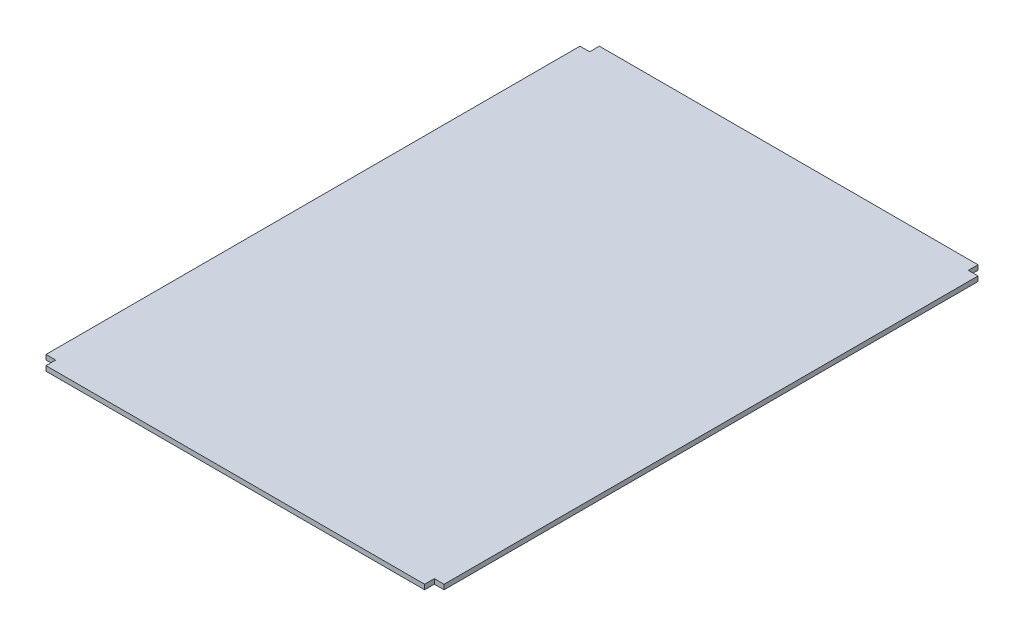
ISO-10303-21;
HEADER;
FILE_DESCRIPTION(('STEP AP214'),'2;1');
FILE_NAME('part.step','',(''),(''),'','','');
FILE_SCHEMA(('AUTOMOTIVE_DESIGN { 1 0 10303 214 1 1 1 1 }'));
ENDSEC;
DATA;
#1=APPLICATION_CONTEXT('core data for automotive mechanical design processes');
#2=APPLICATION_PROTOCOL_DEFINITION('international standard','automotive_design',2000,#1);
#3=PRODUCT_CONTEXT('',#1,'mechanical');
#4=PRODUCT('Part','Part','',(#3));
#5=PRODUCT_RELATED_PRODUCT_CATEGORY('part','',(#4));
#6=PRODUCT_DEFINITION_FORMATION('','',#4);
#7=PRODUCT_DEFINITION_CONTEXT('part definition',#1,'design');
#8=PRODUCT_DEFINITION('design','',#6,#7);
#9=PRODUCT_DEFINITION_SHAPE('','',#8);
#10=(LENGTH_UNIT() NAMED_UNIT(*) SI_UNIT(.MILLI.,.METRE.));
#11=(NAMED_UNIT(*) PLANE_ANGLE_UNIT() SI_UNIT($,.RADIAN.));
#12=(NAMED_UNIT(*) SI_UNIT($,.STERADIAN.) SOLID_ANGLE_UNIT());
#13=UNCERTAINTY_MEASURE_WITH_UNIT(LENGTH_MEASURE(1.E-05),#10,'distance_accuracy_value','');
#14=(GEOMETRIC_REPRESENTATION_CONTEXT(3) GLOBAL_UNCERTAINTY_ASSIGNED_CONTEXT((#13)) GLOBAL_UNIT_ASSIGNED_CONTEXT((#10,
#11,#12)) REPRESENTATION_CONTEXT('',''));
#15=CARTESIAN_POINT('',(0.,0.,0.));
#16=DIRECTION('',(0.,0.,1.));
#17=DIRECTION('',(1.,0.,0.));
#18=AXIS2_PLACEMENT_3D('',#15,#16,#17);
#19=CARTESIAN_POINT('',(260.35,6.35,361.95));
#20=DIRECTION('',(-1.,0.,0.));
#21=DIRECTION('',(0.,0.,1.));
#22=AXIS2_PLACEMENT_3D('',#19,#20,#21);
#23=PLANE('',#22);
#24=DIRECTION('',(0.,0.,-1.));
#25=VECTOR('',#24,1.);
#26=CARTESIAN_POINT('',(260.35,0.,361.95));
#27=LINE('',#26,#25);
#28=CARTESIAN_POINT('',(260.35,0.,349.25));
#29=VERTEX_POINT('',#28);
#30=CARTESIAN_POINT('',(260.35,0.,-349.25));
#31=VERTEX_POINT('',#30);
#32=EDGE_CURVE('E145',#29,#31,#27,.T.);
#33=ORIENTED_EDGE('',*,*,#32,.T.);
#34=DIRECTION('',(0.,1.,0.));
#35=VECTOR('',#34,1.);
#36=CARTESIAN_POINT('',(260.35,0.,-349.25));
#37=LINE('',#36,#35);
#38=CARTESIAN_POINT('',(260.35,6.35,-349.25));
#39=VERTEX_POINT('',#38);
#40=EDGE_CURVE('E188',#31,#39,#37,.T.);
#41=ORIENTED_EDGE('',*,*,#40,.T.);
#42=DIRECTION('',(0.,0.,-1.));
#43=VECTOR('',#42,1.);
#44=CARTESIAN_POINT('',(260.35,6.35,361.95));
#45=LINE('',#44,#43);
#46=CARTESIAN_POINT('',(260.35,6.35,349.25));
#47=VERTEX_POINT('',#46);
#48=EDGE_CURVE('E153',#47,#39,#45,.T.);
#49=ORIENTED_EDGE('',*,*,#48,.F.);
#50=DIRECTION('',(0.,1.,0.));
#51=VECTOR('',#50,1.);
#52=CARTESIAN_POINT('',(260.35,0.,349.25));
#53=LINE('',#52,#51);
#54=EDGE_CURVE('E175',#29,#47,#53,.T.);
#55=ORIENTED_EDGE('',*,*,#54,.F.);
#56=EDGE_LOOP('',(#33,#41,#49,#55));
#57=FACE_BOUND('',#56,.T.);
#58=ADVANCED_FACE('F33',(#57),#23,.F.);
#59=CARTESIAN_POINT('',(-260.35,6.35,-361.95));
#60=DIRECTION('',(0.,0.,1.));
#61=DIRECTION('',(1.,0.,0.));
#62=AXIS2_PLACEMENT_3D('',#59,#60,#61);
#63=PLANE('',#62);
#64=DIRECTION('',(-1.,0.,0.));
#65=VECTOR('',#64,1.);
#66=CARTESIAN_POINT('',(-260.35,6.35,-361.95));
#67=LINE('',#66,#65);
#68=CARTESIAN_POINT('',(247.65,6.35,-361.95));
#69=VERTEX_POINT('',#68);
#70=CARTESIAN_POINT('',(-247.65,6.35,-361.95));
#71=VERTEX_POINT('',#70);
#72=EDGE_CURVE('E140',#69,#71,#67,.T.);
#73=ORIENTED_EDGE('',*,*,#72,.F.);
#74=DIRECTION('',(0.,1.,0.));
#75=VECTOR('',#74,1.);
#76=CARTESIAN_POINT('',(247.65,0.,-361.95));
#77=LINE('',#76,#75);
#78=CARTESIAN_POINT('',(247.65,0.,-361.95));
#79=VERTEX_POINT('',#78);
#80=EDGE_CURVE('E126',#79,#69,#77,.T.);
#81=ORIENTED_EDGE('',*,*,#80,.F.);
#82=DIRECTION('',(-1.,0.,0.));
#83=VECTOR('',#82,1.);
#84=CARTESIAN_POINT('',(-260.35,0.,-361.95));
#85=LINE('',#84,#83);
#86=CARTESIAN_POINT('',(-247.65,0.,-361.95));
#87=VERTEX_POINT('',#86);
#88=EDGE_CURVE('E138',#79,#87,#85,.T.);
#89=ORIENTED_EDGE('',*,*,#88,.T.);
#90=DIRECTION('',(0.,1.,0.));
#91=VECTOR('',#90,1.);
#92=CARTESIAN_POINT('',(-247.65,0.,-361.95));
#93=LINE('',#92,#91);
#94=EDGE_CURVE('E197',#87,#71,#93,.T.);
#95=ORIENTED_EDGE('',*,*,#94,.T.);
#96=EDGE_LOOP('',(#73,#81,#89,#95));
#97=FACE_BOUND('',#96,.T.);
#98=ADVANCED_FACE('F136',(#97),#63,.F.);
#99=CARTESIAN_POINT('',(-260.35,6.35,361.95));
#100=DIRECTION('',(1.,0.,0.));
#101=DIRECTION('',(0.,0.,-1.));
#102=AXIS2_PLACEMENT_3D('',#99,#100,#101);
#103=PLANE('',#102);
#104=DIRECTION('',(0.,0.,1.));
#105=VECTOR('',#104,1.);
#106=CARTESIAN_POINT('',(-260.35,6.35,361.95));
#107=LINE('',#106,#105);
#108=CARTESIAN_POINT('',(-260.35,6.35,-349.25));
#109=VERTEX_POINT('',#108);
#110=CARTESIAN_POINT('',(-260.35,6.35,349.25));
#111=VERTEX_POINT('',#110);
#112=EDGE_CURVE('E41',#109,#111,#107,.T.);
#113=ORIENTED_EDGE('',*,*,#112,.F.);
#114=DIRECTION('',(0.,1.,0.));
#115=VECTOR('',#114,1.);
#116=CARTESIAN_POINT('',(-260.35,0.,-349.25));
#117=LINE('',#116,#115);
#118=CARTESIAN_POINT('',(-260.35,0.,-349.25));
#119=VERTEX_POINT('',#118);
#120=EDGE_CURVE('E193',#119,#109,#117,.T.);
#121=ORIENTED_EDGE('',*,*,#120,.F.);
#122=DIRECTION('',(0.,0.,1.));
#123=VECTOR('',#122,1.);
#124=CARTESIAN_POINT('',(-260.35,0.,361.95));
#125=LINE('',#124,#123);
#126=CARTESIAN_POINT('',(-260.35,0.,349.25));
#127=VERTEX_POINT('',#126);
#128=EDGE_CURVE('E144',#119,#127,#125,.T.);
#129=ORIENTED_EDGE('',*,*,#128,.T.);
#130=DIRECTION('',(0.,1.,0.));
#131=VECTOR('',#130,1.);
#132=CARTESIAN_POINT('',(-260.35,0.,349.25));
#133=LINE('',#132,#131);
#134=EDGE_CURVE('E148',#127,#111,#133,.T.);
#135=ORIENTED_EDGE('',*,*,#134,.T.);
#136=EDGE_LOOP('',(#113,#121,#129,#135));
#137=FACE_BOUND('',#136,.T.);
#138=ADVANCED_FACE('F244',(#137),#103,.F.);
#139=CARTESIAN_POINT('',(-260.35,6.35,361.95));
#140=DIRECTION('',(0.,0.,-1.));
#141=DIRECTION('',(-1.,0.,0.));
#142=AXIS2_PLACEMENT_3D('',#139,#140,#141);
#143=PLANE('',#142);
#144=DIRECTION('',(1.,0.,0.));
#145=VECTOR('',#144,1.);
#146=CARTESIAN_POINT('',(-260.35,0.,361.95));
#147=LINE('',#146,#145);
#148=CARTESIAN_POINT('',(-247.65,0.,361.95));
#149=VERTEX_POINT('',#148);
#150=CARTESIAN_POINT('',(247.65,0.,361.95));
#151=VERTEX_POINT('',#150);
#152=EDGE_CURVE('E36',#149,#151,#147,.T.);
#153=ORIENTED_EDGE('',*,*,#152,.T.);
#154=DIRECTION('',(0.,1.,0.));
#155=VECTOR('',#154,1.);
#156=CARTESIAN_POINT('',(247.65,0.,361.95));
#157=LINE('',#156,#155);
#158=CARTESIAN_POINT('',(247.65,6.35,361.95));
#159=VERTEX_POINT('',#158);
#160=EDGE_CURVE('E170',#151,#159,#157,.T.);
#161=ORIENTED_EDGE('',*,*,#160,.T.);
#162=DIRECTION('',(1.,0.,0.));
#163=VECTOR('',#162,1.);
#164=CARTESIAN_POINT('',(-260.35,6.35,361.95));
#165=LINE('',#164,#163);
#166=CARTESIAN_POINT('',(-247.65,6.35,361.95));
#167=VERTEX_POINT('',#166);
#168=EDGE_CURVE('E11',#167,#159,#165,.T.);
#169=ORIENTED_EDGE('',*,*,#168,.F.);
#170=DIRECTION('',(0.,1.,0.));
#171=VECTOR('',#170,1.);
#172=CARTESIAN_POINT('',(-247.65,0.,361.95));
#173=LINE('',#172,#171);
#174=EDGE_CURVE('E156',#149,#167,#173,.T.);
#175=ORIENTED_EDGE('',*,*,#174,.F.);
#176=EDGE_LOOP('',(#153,#161,#169,#175));
#177=FACE_BOUND('',#176,.T.);
#178=ADVANCED_FACE('F231',(#177),#143,.F.);
#179=CARTESIAN_POINT('',(0.,6.35,0.));
#180=DIRECTION('',(0.,-1.,0.));
#181=DIRECTION('',(0.,0.,-1.));
#182=AXIS2_PLACEMENT_3D('',#179,#180,#181);
#183=PLANE('',#182);
#184=ORIENTED_EDGE('',*,*,#48,.T.);
#185=DIRECTION('',(1.,0.,0.));
#186=VECTOR('',#185,1.);
#187=CARTESIAN_POINT('',(260.35,6.35,-349.25));
#188=LINE('',#187,#186);
#189=CARTESIAN_POINT('',(247.65,6.35,-349.25));
#190=VERTEX_POINT('',#189);
#191=EDGE_CURVE('E131',#190,#39,#188,.T.);
#192=ORIENTED_EDGE('',*,*,#191,.F.);
#193=DIRECTION('',(0.,0.,1.));
#194=VECTOR('',#193,1.);
#195=CARTESIAN_POINT('',(247.65,6.35,-361.95));
#196=LINE('',#195,#194);
#197=EDGE_CURVE('E199',#69,#190,#196,.T.);
#198=ORIENTED_EDGE('',*,*,#197,.F.);
#199=ORIENTED_EDGE('',*,*,#72,.T.);
#200=DIRECTION('',(0.,0.,-1.));
#201=VECTOR('',#200,1.);
#202=CARTESIAN_POINT('',(-247.65,6.35,-361.95));
#203=LINE('',#202,#201);
#204=CARTESIAN_POINT('',(-247.65,6.35,-349.25));
#205=VERTEX_POINT('',#204);
#206=EDGE_CURVE('E200',#205,#71,#203,.T.);
#207=ORIENTED_EDGE('',*,*,#206,.F.);
#208=DIRECTION('',(1.,0.,0.));
#209=VECTOR('',#208,1.);
#210=CARTESIAN_POINT('',(-260.35,6.35,-349.25));
#211=LINE('',#210,#209);
#212=EDGE_CURVE('E203',#109,#205,#211,.T.);
#213=ORIENTED_EDGE('',*,*,#212,.F.);
#214=ORIENTED_EDGE('',*,*,#112,.T.);
#215=DIRECTION('',(-1.,0.,0.));
#216=VECTOR('',#215,1.);
#217=CARTESIAN_POINT('',(-260.35,6.35,349.25));
#218=LINE('',#217,#216);
#219=CARTESIAN_POINT('',(-247.65,6.35,349.25));
#220=VERTEX_POINT('',#219);
#221=EDGE_CURVE('E163',#220,#111,#218,.T.);
#222=ORIENTED_EDGE('',*,*,#221,.F.);
#223=DIRECTION('',(0.,0.,-1.));
#224=VECTOR('',#223,1.);
#225=CARTESIAN_POINT('',(-247.65,6.35,361.95));
#226=LINE('',#225,#224);
#227=EDGE_CURVE('E167',#167,#220,#226,.T.);
#228=ORIENTED_EDGE('',*,*,#227,.F.);
#229=ORIENTED_EDGE('',*,*,#168,.T.);
#230=DIRECTION('',(0.,0.,1.));
#231=VECTOR('',#230,1.);
#232=CARTESIAN_POINT('',(247.65,6.35,361.95));
#233=LINE('',#232,#231);
#234=CARTESIAN_POINT('',(247.65,6.35,349.25));
#235=VERTEX_POINT('',#234);
#236=EDGE_CURVE('E182',#235,#159,#233,.T.);
#237=ORIENTED_EDGE('',*,*,#236,.F.);
#238=DIRECTION('',(-1.,0.,0.));
#239=VECTOR('',#238,1.);
#240=CARTESIAN_POINT('',(260.35,6.35,349.25));
#241=LINE('',#240,#239);
#242=EDGE_CURVE('E185',#47,#235,#241,.T.);
#243=ORIENTED_EDGE('',*,*,#242,.F.);
#244=EDGE_LOOP('',(#184,#192,#198,#199,#207,#213,#214,#222,#228,#229,#237,#243));
#245=FACE_BOUND('',#244,.T.);
#246=ADVANCED_FACE('F223',(#245),#183,.F.);
#247=CARTESIAN_POINT('',(0.,0.,0.));
#248=DIRECTION('',(0.,-1.,0.));
#249=DIRECTION('',(0.,0.,-1.));
#250=AXIS2_PLACEMENT_3D('',#247,#248,#249);
#251=PLANE('',#250);
#252=DIRECTION('',(1.,0.,0.));
#253=VECTOR('',#252,1.);
#254=CARTESIAN_POINT('',(260.35,0.,-349.25));
#255=LINE('',#254,#253);
#256=CARTESIAN_POINT('',(247.65,0.,-349.25));
#257=VERTEX_POINT('',#256);
#258=EDGE_CURVE('E49',#257,#31,#255,.T.);
#259=ORIENTED_EDGE('',*,*,#258,.T.);
#260=ORIENTED_EDGE('',*,*,#32,.F.);
#261=DIRECTION('',(-1.,0.,0.));
#262=VECTOR('',#261,1.);
#263=CARTESIAN_POINT('',(260.35,0.,349.25));
#264=LINE('',#263,#262);
#265=CARTESIAN_POINT('',(247.65,0.,349.25));
#266=VERTEX_POINT('',#265);
#267=EDGE_CURVE('E184',#29,#266,#264,.T.);
#268=ORIENTED_EDGE('',*,*,#267,.T.);
#269=DIRECTION('',(0.,0.,1.));
#270=VECTOR('',#269,1.);
#271=CARTESIAN_POINT('',(247.65,0.,361.95));
#272=LINE('',#271,#270);
#273=EDGE_CURVE('E178',#266,#151,#272,.T.);
#274=ORIENTED_EDGE('',*,*,#273,.T.);
#275=ORIENTED_EDGE('',*,*,#152,.F.);
#276=DIRECTION('',(0.,0.,-1.));
#277=VECTOR('',#276,1.);
#278=CARTESIAN_POINT('',(-247.65,0.,361.95));
#279=LINE('',#278,#277);
#280=CARTESIAN_POINT('',(-247.65,0.,349.25));
#281=VERTEX_POINT('',#280);
#282=EDGE_CURVE('E166',#149,#281,#279,.T.);
#283=ORIENTED_EDGE('',*,*,#282,.T.);
#284=DIRECTION('',(-1.,0.,0.));
#285=VECTOR('',#284,1.);
#286=CARTESIAN_POINT('',(-260.35,0.,349.25));
#287=LINE('',#286,#285);
#288=EDGE_CURVE('E159',#281,#127,#287,.T.);
#289=ORIENTED_EDGE('',*,*,#288,.T.);
#290=ORIENTED_EDGE('',*,*,#128,.F.);
#291=DIRECTION('',(1.,0.,0.));
#292=VECTOR('',#291,1.);
#293=CARTESIAN_POINT('',(-260.35,0.,-349.25));
#294=LINE('',#293,#292);
#295=CARTESIAN_POINT('',(-247.65,0.,-349.25));
#296=VERTEX_POINT('',#295);
#297=EDGE_CURVE('E202',#119,#296,#294,.T.);
#298=ORIENTED_EDGE('',*,*,#297,.T.);
#299=DIRECTION('',(0.,0.,-1.));
#300=VECTOR('',#299,1.);
#301=CARTESIAN_POINT('',(-247.65,0.,-361.95));
#302=LINE('',#301,#300);
#303=EDGE_CURVE('E57',#296,#87,#302,.T.);
#304=ORIENTED_EDGE('',*,*,#303,.T.);
#305=ORIENTED_EDGE('',*,*,#88,.F.);
#306=DIRECTION('',(0.,0.,1.));
#307=VECTOR('',#306,1.);
#308=CARTESIAN_POINT('',(247.65,0.,-361.95));
#309=LINE('',#308,#307);
#310=EDGE_CURVE('E122',#79,#257,#309,.T.);
#311=ORIENTED_EDGE('',*,*,#310,.T.);
#312=EDGE_LOOP('',(#259,#260,#268,#274,#275,#283,#289,#290,#298,#304,#305,#311));
#313=FACE_BOUND('',#312,.T.);
#314=ADVANCED_FACE('F142',(#313),#251,.T.);
#315=CARTESIAN_POINT('',(-260.35,0.,349.25));
#316=DIRECTION('',(0.,0.,-1.));
#317=DIRECTION('',(-1.,0.,0.));
#318=AXIS2_PLACEMENT_3D('',#315,#316,#317);
#319=PLANE('',#318);
#320=ORIENTED_EDGE('',*,*,#221,.T.);
#321=ORIENTED_EDGE('',*,*,#134,.F.);
#322=ORIENTED_EDGE('',*,*,#288,.F.);
#323=DIRECTION('',(0.,1.,0.));
#324=VECTOR('',#323,1.);
#325=CARTESIAN_POINT('',(-247.65,0.,349.25));
#326=LINE('',#325,#324);
#327=EDGE_CURVE('E158',#281,#220,#326,.T.);
#328=ORIENTED_EDGE('',*,*,#327,.T.);
#329=EDGE_LOOP('',(#320,#321,#322,#328));
#330=FACE_BOUND('',#329,.T.);
#331=ADVANCED_FACE('F240',(#330),#319,.F.);
#332=CARTESIAN_POINT('',(-247.65,0.,361.95));
#333=DIRECTION('',(1.,0.,0.));
#334=DIRECTION('',(0.,0.,-1.));
#335=AXIS2_PLACEMENT_3D('',#332,#333,#334);
#336=PLANE('',#335);
#337=ORIENTED_EDGE('',*,*,#227,.T.);
#338=ORIENTED_EDGE('',*,*,#327,.F.);
#339=ORIENTED_EDGE('',*,*,#282,.F.);
#340=ORIENTED_EDGE('',*,*,#174,.T.);
#341=EDGE_LOOP('',(#337,#338,#339,#340));
#342=FACE_BOUND('',#341,.T.);
#343=ADVANCED_FACE('F237',(#342),#336,.F.);
#344=CARTESIAN_POINT('',(247.65,0.,361.95));
#345=DIRECTION('',(-1.,0.,0.));
#346=DIRECTION('',(0.,0.,1.));
#347=AXIS2_PLACEMENT_3D('',#344,#345,#346);
#348=PLANE('',#347);
#349=ORIENTED_EDGE('',*,*,#236,.T.);
#350=ORIENTED_EDGE('',*,*,#160,.F.);
#351=ORIENTED_EDGE('',*,*,#273,.F.);
#352=DIRECTION('',(0.,1.,0.));
#353=VECTOR('',#352,1.);
#354=CARTESIAN_POINT('',(247.65,0.,349.25));
#355=LINE('',#354,#353);
#356=EDGE_CURVE('E177',#266,#235,#355,.T.);
#357=ORIENTED_EDGE('',*,*,#356,.T.);
#358=EDGE_LOOP('',(#349,#350,#351,#357));
#359=FACE_BOUND('',#358,.T.);
#360=ADVANCED_FACE('F228',(#359),#348,.F.);
#361=CARTESIAN_POINT('',(260.35,0.,349.25));
#362=DIRECTION('',(0.,0.,-1.));
#363=DIRECTION('',(-1.,0.,0.));
#364=AXIS2_PLACEMENT_3D('',#361,#362,#363);
#365=PLANE('',#364);
#366=ORIENTED_EDGE('',*,*,#242,.T.);
#367=ORIENTED_EDGE('',*,*,#356,.F.);
#368=ORIENTED_EDGE('',*,*,#267,.F.);
#369=ORIENTED_EDGE('',*,*,#54,.T.);
#370=EDGE_LOOP('',(#366,#367,#368,#369));
#371=FACE_BOUND('',#370,.T.);
#372=ADVANCED_FACE('F219',(#371),#365,.F.);
#373=CARTESIAN_POINT('',(-247.65,0.,-361.95));
#374=DIRECTION('',(1.,0.,0.));
#375=DIRECTION('',(0.,0.,-1.));
#376=AXIS2_PLACEMENT_3D('',#373,#374,#375);
#377=PLANE('',#376);
#378=ORIENTED_EDGE('',*,*,#206,.T.);
#379=ORIENTED_EDGE('',*,*,#94,.F.);
#380=ORIENTED_EDGE('',*,*,#303,.F.);
#381=DIRECTION('',(0.,1.,0.));
#382=VECTOR('',#381,1.);
#383=CARTESIAN_POINT('',(-247.65,0.,-349.25));
#384=LINE('',#383,#382);
#385=EDGE_CURVE('E195',#296,#205,#384,.T.);
#386=ORIENTED_EDGE('',*,*,#385,.T.);
#387=EDGE_LOOP('',(#378,#379,#380,#386));
#388=FACE_BOUND('',#387,.T.);
#389=ADVANCED_FACE('F250',(#388),#377,.F.);
#390=CARTESIAN_POINT('',(-260.35,0.,-349.25));
#391=DIRECTION('',(0.,0.,1.));
#392=DIRECTION('',(1.,0.,0.));
#393=AXIS2_PLACEMENT_3D('',#390,#391,#392);
#394=PLANE('',#393);
#395=ORIENTED_EDGE('',*,*,#212,.T.);
#396=ORIENTED_EDGE('',*,*,#385,.F.);
#397=ORIENTED_EDGE('',*,*,#297,.F.);
#398=ORIENTED_EDGE('',*,*,#120,.T.);
#399=EDGE_LOOP('',(#395,#396,#397,#398));
#400=FACE_BOUND('',#399,.T.);
#401=ADVANCED_FACE('F247',(#400),#394,.F.);
#402=CARTESIAN_POINT('',(260.35,0.,-349.25));
#403=DIRECTION('',(0.,0.,1.));
#404=DIRECTION('',(1.,0.,0.));
#405=AXIS2_PLACEMENT_3D('',#402,#403,#404);
#406=PLANE('',#405);
#407=ORIENTED_EDGE('',*,*,#191,.T.);
#408=ORIENTED_EDGE('',*,*,#40,.F.);
#409=ORIENTED_EDGE('',*,*,#258,.F.);
#410=DIRECTION('',(0.,1.,0.));
#411=VECTOR('',#410,1.);
#412=CARTESIAN_POINT('',(247.65,0.,-349.25));
#413=LINE('',#412,#411);
#414=EDGE_CURVE('E128',#257,#190,#413,.T.);
#415=ORIENTED_EDGE('',*,*,#414,.T.);
#416=EDGE_LOOP('',(#407,#408,#409,#415));
#417=FACE_BOUND('',#416,.T.);
#418=ADVANCED_FACE('F251',(#417),#406,.F.);
#419=CARTESIAN_POINT('',(247.65,0.,-361.95));
#420=DIRECTION('',(-1.,0.,0.));
#421=DIRECTION('',(0.,0.,1.));
#422=AXIS2_PLACEMENT_3D('',#419,#420,#421);
#423=PLANE('',#422);
#424=ORIENTED_EDGE('',*,*,#197,.T.);
#425=ORIENTED_EDGE('',*,*,#414,.F.);
#426=ORIENTED_EDGE('',*,*,#310,.F.);
#427=ORIENTED_EDGE('',*,*,#80,.T.);
#428=EDGE_LOOP('',(#424,#425,#426,#427));
#429=FACE_BOUND('',#428,.T.);
#430=ADVANCED_FACE('F125',(#429),#423,.F.);
#431=CLOSED_SHELL('',(#58,#98,#138,#178,#246,#314,#331,#343,#360,#372,#389,#401,#418,#430));
#432=MANIFOLD_SOLID_BREP('B2',#431);
#433=ADVANCED_BREP_SHAPE_REPRESENTATION('',(#18,#432),#14);
#434=SHAPE_DEFINITION_REPRESENTATION(#9,#433);
ENDSEC;
END-ISO-10303-21;
